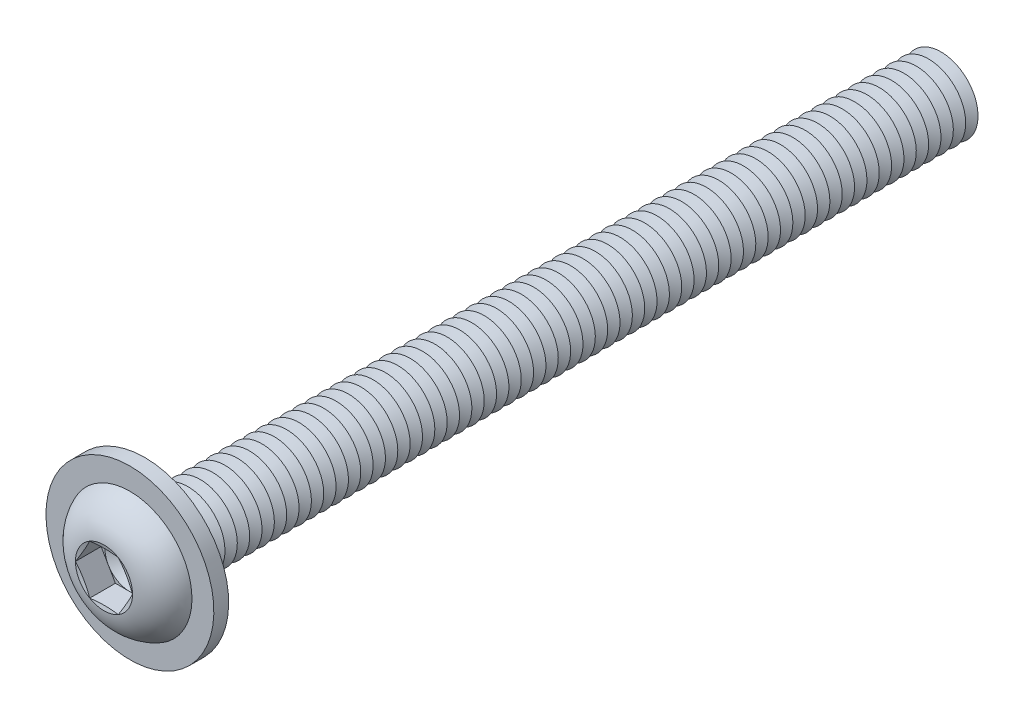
from build123d import *

# Parameters (mm, degrees)
FILLET1_R           = 0.5
LPATTERN1_COUNT     = 65
LPATTERN1_PITCH     = 1
CUT_EXTRUDE1_DEPTH  = 2.08
SKETCH5_R           = 6.8
SKETCH5_R_2         = 3.5
BOSS_EXTRUDE1_DEPTH = 1.2


with BuildPart() as part:
    # Sketch1 → Revolve1 (revolve)
    with BuildSketch(Plane(origin=(0, 0, 0), x_dir=(0, 0, -1), z_dir=(1, 0, 0))):
        with BuildLine():
            Line((0, 3), (0, 5.25))
            ThreePointArc((0, 5.25), (-2.210041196, 4.408189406), (-3.3, 2.3094))
            Line((-3.3, 2.3094), (-2.990599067, 1.1547))
            Line((-2.990599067, 1.1547), (-3.3, 1.1547))
            Line((-3.3, 1.1547), (-3.3, 0))
            Line((-3.3, 0), (65, 0))
            Line((65, 0), (65, 3))
            Line((65, 3), (0, 3))
        make_face()
    revolve(axis=Axis((0, 0, -65), (0, 0, 1)))

    # Fillet1
    fillet1_edges = [part.edges().sort_by_distance(p)[0] for p in [
        (0, -3, 0),
    ]]
    fillet(fillet1_edges, radius=FILLET1_R)

    # Sketch2 → Cut-Revolve1 (revolve, cut)
    with BuildSketch(Plane(origin=(0, 0, 0), x_dir=(0, 0, -1), z_dir=(1, 0, 0))):
        Polygon((64.5, 3), (65.5, 3), (65, 2.133974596), align=None)
    cut_revolve1 = revolve(axis=Axis((0, 0, -65), (0, 0, -1)), mode=Mode.SUBTRACT)

    # LPattern1: Cut-Revolve1 ×65
    with Locations(*[(0, 0, i * LPATTERN1_PITCH) for i in range(1, LPATTERN1_COUNT)]):
        add(cut_revolve1, mode=Mode.SUBTRACT)

    # Sketch3 → Cut-Extrude1 (cut)
    with BuildSketch(Plane.XY.offset(3.3)):
        Polygon((1.1547, 1.999999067), (-1.1547, 1.999999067), (-2.3094, 0), (-1.1547, -1.999999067), (1.1547, -1.999999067), (2.3094, 0), align=None)
    extrude(amount=-CUT_EXTRUDE1_DEPTH, mode=Mode.SUBTRACT)

    # Cut-Extrude2 cone 1 section (on through the dimple's axis) → Cut-Extrude2 (revolve, cut)
    with BuildSketch(Plane(origin=(0, 0, 1.22), x_dir=(0, -1, 0), z_dir=(1, 0, 0))):
        Polygon((0, 0), (1.999999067, 0), (0, 1.1547), align=None)
    revolve(axis=Axis((0, 0, 1.22), (0, 0, -1)), mode=Mode.SUBTRACT)

    # Sketch5 → Boss-Extrude1 (add)
    with BuildSketch(Plane(origin=(0, 0, 0), x_dir=(-1, 0, 0), z_dir=(0, 0, -1))):
        with Locations(Location((0, 0, 0), (0, 0, 90))):
            Circle(SKETCH5_R)
        Circle(SKETCH5_R_2, mode=Mode.SUBTRACT)
    extrude(amount=-BOSS_EXTRUDE1_DEPTH)


solid = part.part
